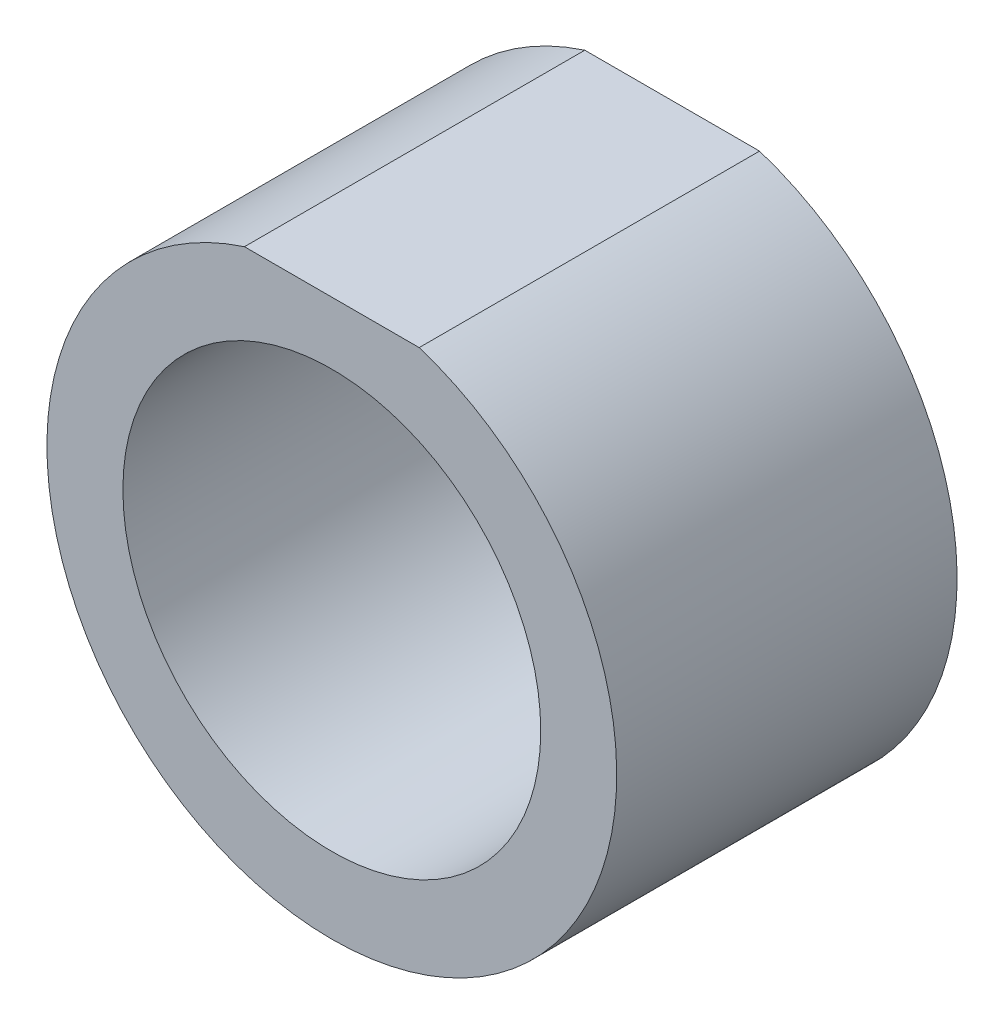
ISO-10303-21;
HEADER;
FILE_DESCRIPTION(('STEP AP214'),'2;1');
FILE_NAME('part.step','',(''),(''),'','','');
FILE_SCHEMA(('AUTOMOTIVE_DESIGN { 1 0 10303 214 1 1 1 1 }'));
ENDSEC;
DATA;
#1=APPLICATION_CONTEXT('core data for automotive mechanical design processes');
#2=APPLICATION_PROTOCOL_DEFINITION('international standard','automotive_design',2000,#1);
#3=PRODUCT_CONTEXT('',#1,'mechanical');
#4=PRODUCT('Part','Part','',(#3));
#5=PRODUCT_RELATED_PRODUCT_CATEGORY('part','',(#4));
#6=PRODUCT_DEFINITION_FORMATION('','',#4);
#7=PRODUCT_DEFINITION_CONTEXT('part definition',#1,'design');
#8=PRODUCT_DEFINITION('design','',#6,#7);
#9=PRODUCT_DEFINITION_SHAPE('','',#8);
#10=(LENGTH_UNIT() NAMED_UNIT(*) SI_UNIT(.MILLI.,.METRE.));
#11=(NAMED_UNIT(*) PLANE_ANGLE_UNIT() SI_UNIT($,.RADIAN.));
#12=(NAMED_UNIT(*) SI_UNIT($,.STERADIAN.) SOLID_ANGLE_UNIT());
#13=UNCERTAINTY_MEASURE_WITH_UNIT(LENGTH_MEASURE(1.E-05),#10,'distance_accuracy_value','');
#14=(GEOMETRIC_REPRESENTATION_CONTEXT(3) GLOBAL_UNCERTAINTY_ASSIGNED_CONTEXT((#13)) GLOBAL_UNIT_ASSIGNED_CONTEXT((#10,
#11,#12)) REPRESENTATION_CONTEXT('',''));
#15=CARTESIAN_POINT('',(0.,0.,0.));
#16=DIRECTION('',(0.,0.,1.));
#17=DIRECTION('',(1.,0.,0.));
#18=AXIS2_PLACEMENT_3D('',#15,#16,#17);
#19=CARTESIAN_POINT('',(0.,0.,11.3792));
#20=DIRECTION('',(0.,0.,1.));
#21=DIRECTION('',(1.,0.,0.));
#22=AXIS2_PLACEMENT_3D('',#19,#20,#21);
#23=PLANE('',#22);
#24=DIRECTION('',(1.,0.,0.));
#25=VECTOR('',#24,1.);
#26=CARTESIAN_POINT('',(-2.921,9.06605669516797,11.3792));
#27=LINE('',#26,#25);
#28=CARTESIAN_POINT('',(-2.921,9.06605669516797,11.3792));
#29=VERTEX_POINT('',#28);
#30=CARTESIAN_POINT('',(2.92100000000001,9.06605669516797,11.3792));
#31=VERTEX_POINT('',#30);
#32=EDGE_CURVE('E46',#29,#31,#27,.T.);
#33=ORIENTED_EDGE('',*,*,#32,.F.);
#34=CARTESIAN_POINT('',(0.,0.,11.3792));
#35=DIRECTION('',(0.,0.,1.));
#36=DIRECTION('',(1.,0.,0.));
#37=AXIS2_PLACEMENT_3D('',#34,#35,#36);
#38=CIRCLE('',#37,9.525);
#39=EDGE_CURVE('E11',#29,#31,#38,.T.);
#40=ORIENTED_EDGE('',*,*,#39,.T.);
#41=EDGE_LOOP('',(#33,#40));
#42=FACE_BOUND('',#41,.T.);
#43=CARTESIAN_POINT('',(0.,0.,11.3792));
#44=DIRECTION('',(0.,0.,1.));
#45=DIRECTION('',(1.,0.,0.));
#46=AXIS2_PLACEMENT_3D('',#43,#44,#45);
#47=CIRCLE('',#46,6.985);
#48=CARTESIAN_POINT('',(6.985,0.,11.3792));
#49=VERTEX_POINT('',#48);
#50=EDGE_CURVE('E70',#49,#49,#47,.T.);
#51=ORIENTED_EDGE('',*,*,#50,.F.);
#52=EDGE_LOOP('',(#51));
#53=FACE_BOUND('',#52,.T.);
#54=ADVANCED_FACE('F31',(#42,#53),#23,.T.);
#55=CARTESIAN_POINT('',(0.,0.,0.));
#56=DIRECTION('',(0.,0.,1.));
#57=DIRECTION('',(1.,0.,0.));
#58=AXIS2_PLACEMENT_3D('',#55,#56,#57);
#59=PLANE('',#58);
#60=CARTESIAN_POINT('',(0.,0.,0.));
#61=DIRECTION('',(0.,0.,1.));
#62=DIRECTION('',(1.,0.,0.));
#63=AXIS2_PLACEMENT_3D('',#60,#61,#62);
#64=CIRCLE('',#63,9.525);
#65=CARTESIAN_POINT('',(-2.921,9.06605669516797,0.));
#66=VERTEX_POINT('',#65);
#67=CARTESIAN_POINT('',(2.921,9.06605669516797,0.));
#68=VERTEX_POINT('',#67);
#69=EDGE_CURVE('E39',#66,#68,#64,.T.);
#70=ORIENTED_EDGE('',*,*,#69,.F.);
#71=DIRECTION('',(1.,0.,0.));
#72=VECTOR('',#71,1.);
#73=CARTESIAN_POINT('',(-2.921,9.06605669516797,0.));
#74=LINE('',#73,#72);
#75=EDGE_CURVE('E58',#66,#68,#74,.T.);
#76=ORIENTED_EDGE('',*,*,#75,.T.);
#77=EDGE_LOOP('',(#70,#76));
#78=FACE_BOUND('',#77,.T.);
#79=CARTESIAN_POINT('',(0.,0.,0.));
#80=DIRECTION('',(0.,0.,1.));
#81=DIRECTION('',(1.,0.,0.));
#82=AXIS2_PLACEMENT_3D('',#79,#80,#81);
#83=CIRCLE('',#82,6.985);
#84=CARTESIAN_POINT('',(6.985,0.,0.));
#85=VERTEX_POINT('',#84);
#86=EDGE_CURVE('E67',#85,#85,#83,.T.);
#87=ORIENTED_EDGE('',*,*,#86,.T.);
#88=EDGE_LOOP('',(#87));
#89=FACE_BOUND('',#88,.T.);
#90=ADVANCED_FACE('F80',(#78,#89),#59,.F.);
#91=CARTESIAN_POINT('',(0.,0.,11.3792));
#92=DIRECTION('',(0.,0.,-1.));
#93=DIRECTION('',(-1.,0.,0.));
#94=AXIS2_PLACEMENT_3D('',#91,#92,#93);
#95=CYLINDRICAL_SURFACE('',#94,9.525);
#96=ORIENTED_EDGE('',*,*,#39,.F.);
#97=DIRECTION('',(0.,0.,1.));
#98=VECTOR('',#97,1.);
#99=CARTESIAN_POINT('',(-2.921,9.06605669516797,0.));
#100=LINE('',#99,#98);
#101=EDGE_CURVE('E56',#66,#29,#100,.T.);
#102=ORIENTED_EDGE('',*,*,#101,.F.);
#103=ORIENTED_EDGE('',*,*,#69,.T.);
#104=DIRECTION('',(0.,0.,1.));
#105=VECTOR('',#104,1.);
#106=CARTESIAN_POINT('',(2.921,9.06605669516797,0.));
#107=LINE('',#106,#105);
#108=EDGE_CURVE('E50',#68,#31,#107,.T.);
#109=ORIENTED_EDGE('',*,*,#108,.T.);
#110=EDGE_LOOP('',(#96,#102,#103,#109));
#111=FACE_BOUND('',#110,.T.);
#112=ADVANCED_FACE('F33',(#111),#95,.T.);
#113=CARTESIAN_POINT('',(0.,0.,11.3792));
#114=DIRECTION('',(0.,0.,-1.));
#115=DIRECTION('',(-1.,0.,0.));
#116=AXIS2_PLACEMENT_3D('',#113,#114,#115);
#117=CYLINDRICAL_SURFACE('',#116,6.985);
#118=ORIENTED_EDGE('',*,*,#50,.T.);
#119=EDGE_LOOP('',(#118));
#120=FACE_BOUND('',#119,.T.);
#121=ORIENTED_EDGE('',*,*,#86,.F.);
#122=EDGE_LOOP('',(#121));
#123=FACE_BOUND('',#122,.T.);
#124=ADVANCED_FACE('F77',(#120,#123),#117,.F.);
#125=CARTESIAN_POINT('',(-2.921,9.06605669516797,0.));
#126=DIRECTION('',(0.,-1.,0.));
#127=DIRECTION('',(0.,0.,-1.));
#128=AXIS2_PLACEMENT_3D('',#125,#126,#127);
#129=PLANE('',#128);
#130=ORIENTED_EDGE('',*,*,#32,.T.);
#131=ORIENTED_EDGE('',*,*,#108,.F.);
#132=ORIENTED_EDGE('',*,*,#75,.F.);
#133=ORIENTED_EDGE('',*,*,#101,.T.);
#134=EDGE_LOOP('',(#130,#131,#132,#133));
#135=FACE_BOUND('',#134,.T.);
#136=ADVANCED_FACE('F57',(#135),#129,.F.);
#137=CLOSED_SHELL('',(#54,#90,#112,#124,#136));
#138=MANIFOLD_SOLID_BREP('B2',#137);
#139=ADVANCED_BREP_SHAPE_REPRESENTATION('',(#18,#138),#14);
#140=SHAPE_DEFINITION_REPRESENTATION(#9,#139);
ENDSEC;
END-ISO-10303-21;
